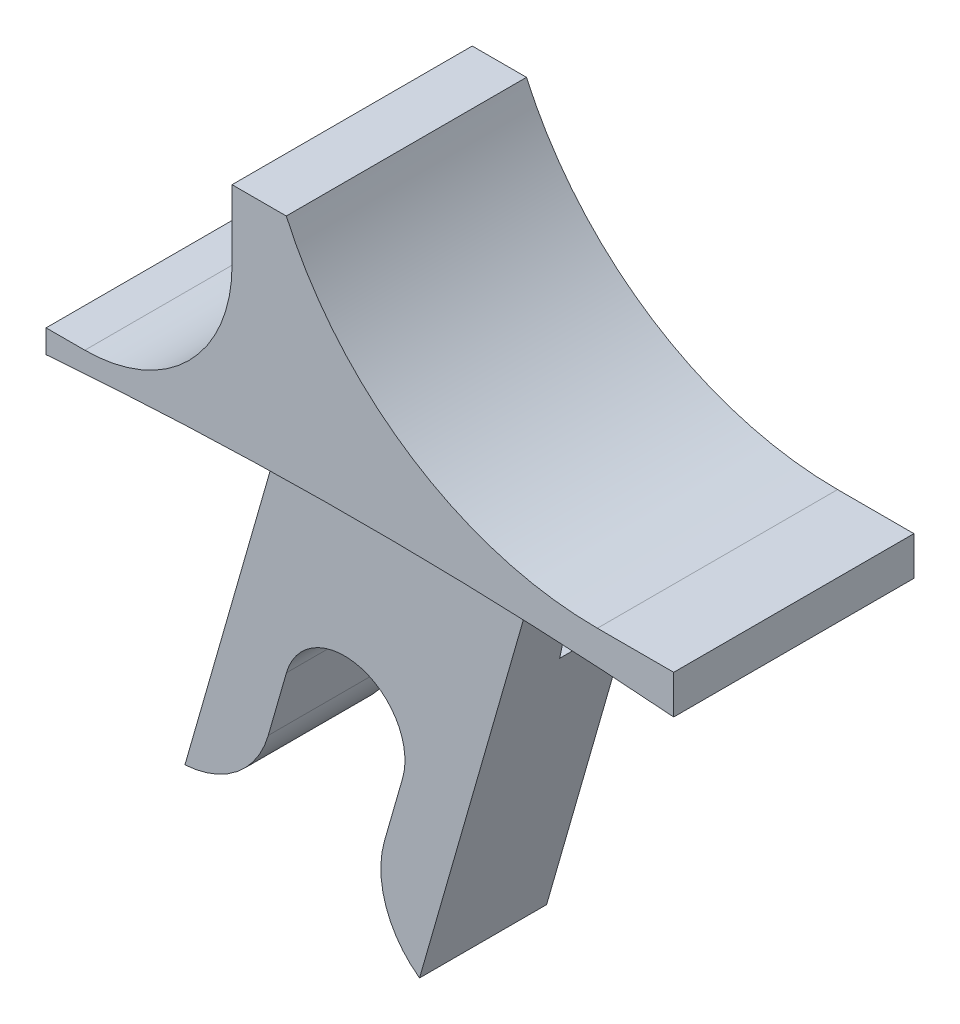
ISO-10303-21;
HEADER;
FILE_DESCRIPTION(('STEP AP214'),'2;1');
FILE_NAME('part.step','',(''),(''),'','','');
FILE_SCHEMA(('AUTOMOTIVE_DESIGN { 1 0 10303 214 1 1 1 1 }'));
ENDSEC;
DATA;
#1=APPLICATION_CONTEXT('core data for automotive mechanical design processes');
#2=APPLICATION_PROTOCOL_DEFINITION('international standard','automotive_design',2000,#1);
#3=PRODUCT_CONTEXT('',#1,'mechanical');
#4=PRODUCT('Part','Part','',(#3));
#5=PRODUCT_RELATED_PRODUCT_CATEGORY('part','',(#4));
#6=PRODUCT_DEFINITION_FORMATION('','',#4);
#7=PRODUCT_DEFINITION_CONTEXT('part definition',#1,'design');
#8=PRODUCT_DEFINITION('design','',#6,#7);
#9=PRODUCT_DEFINITION_SHAPE('','',#8);
#10=(LENGTH_UNIT() NAMED_UNIT(*) SI_UNIT(.MILLI.,.METRE.));
#11=(NAMED_UNIT(*) PLANE_ANGLE_UNIT() SI_UNIT($,.RADIAN.));
#12=(NAMED_UNIT(*) SI_UNIT($,.STERADIAN.) SOLID_ANGLE_UNIT());
#13=UNCERTAINTY_MEASURE_WITH_UNIT(LENGTH_MEASURE(1.E-05),#10,'distance_accuracy_value','');
#14=(GEOMETRIC_REPRESENTATION_CONTEXT(3) GLOBAL_UNCERTAINTY_ASSIGNED_CONTEXT((#13)) GLOBAL_UNIT_ASSIGNED_CONTEXT((#10,
#11,#12)) REPRESENTATION_CONTEXT('',''));
#15=CARTESIAN_POINT('',(0.,0.,0.));
#16=DIRECTION('',(0.,0.,1.));
#17=DIRECTION('',(1.,0.,0.));
#18=AXIS2_PLACEMENT_3D('',#15,#16,#17);
#19=CARTESIAN_POINT('',(-5.85412425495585,1.67864311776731,2.0828));
#20=DIRECTION('',(0.961261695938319,-0.275637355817,0.));
#21=DIRECTION('',(0.275637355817,0.961261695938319,0.));
#22=AXIS2_PLACEMENT_3D('',#19,#20,#21);
#23=PLANE('',#22);
#24=DIRECTION('',(-0.275637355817,-0.961261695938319,0.));
#25=VECTOR('',#24,1.);
#26=CARTESIAN_POINT('',(-5.85412425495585,1.67864311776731,-2.0828));
#27=LINE('',#26,#25);
#28=CARTESIAN_POINT('',(-7.4607423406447,-3.9243,-2.0828));
#29=VERTEX_POINT('',#28);
#30=CARTESIAN_POINT('',(-10.1861212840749,-13.4288258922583,-2.0828));
#31=VERTEX_POINT('',#30);
#32=EDGE_CURVE('E241',#29,#31,#27,.T.);
#33=ORIENTED_EDGE('',*,*,#32,.F.);
#34=DIRECTION('',(0.,0.,1.));
#35=VECTOR('',#34,1.);
#36=CARTESIAN_POINT('',(-7.4607423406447,-3.9243,2.0828));
#37=LINE('',#36,#35);
#38=CARTESIAN_POINT('',(-7.4607423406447,-3.9243,0.213824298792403));
#39=VERTEX_POINT('',#38);
#40=EDGE_CURVE('E218',#29,#39,#37,.T.);
#41=ORIENTED_EDGE('',*,*,#40,.T.);
#42=DIRECTION('',(-0.274260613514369,-0.956460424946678,-0.0998226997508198));
#43=VECTOR('',#42,1.);
#44=CARTESIAN_POINT('',(-5.81896575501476,1.80125537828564,0.811382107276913));
#45=LINE('',#44,#43);
#46=CARTESIAN_POINT('',(-6.65229240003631,-1.1049,0.508076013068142));
#47=VERTEX_POINT('',#46);
#48=EDGE_CURVE('E11',#47,#39,#45,.T.);
#49=ORIENTED_EDGE('',*,*,#48,.F.);
#50=DIRECTION('',(0.,0.,1.));
#51=VECTOR('',#50,1.);
#52=CARTESIAN_POINT('',(-6.65229240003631,-1.1049,2.0828));
#53=LINE('',#52,#51);
#54=CARTESIAN_POINT('',(-6.65229240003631,-1.1049,-2.0828));
#55=VERTEX_POINT('',#54);
#56=EDGE_CURVE('E215',#55,#47,#53,.T.);
#57=ORIENTED_EDGE('',*,*,#56,.F.);
#58=CARTESIAN_POINT('',(-6.23747108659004,0.341753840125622,-2.0828));
#59=VERTEX_POINT('',#58);
#60=EDGE_CURVE('E242',#59,#55,#27,.T.);
#61=ORIENTED_EDGE('',*,*,#60,.F.);
#62=DIRECTION('',(0.,0.,-1.));
#63=VECTOR('',#62,1.);
#64=CARTESIAN_POINT('',(-6.23747108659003,0.341753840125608,3.937));
#65=LINE('',#64,#63);
#66=CARTESIAN_POINT('',(-6.23747108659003,0.341753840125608,2.0828));
#67=VERTEX_POINT('',#66);
#68=EDGE_CURVE('E344',#67,#59,#65,.T.);
#69=ORIENTED_EDGE('',*,*,#68,.F.);
#70=DIRECTION('',(-0.275637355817,-0.961261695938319,0.));
#71=VECTOR('',#70,1.);
#72=CARTESIAN_POINT('',(-5.85412425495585,1.67864311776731,2.0828));
#73=LINE('',#72,#71);
#74=CARTESIAN_POINT('',(-10.1861212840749,-13.4288258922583,2.0828));
#75=VERTEX_POINT('',#74);
#76=EDGE_CURVE('E224',#67,#75,#73,.T.);
#77=ORIENTED_EDGE('',*,*,#76,.T.);
#78=DIRECTION('',(0.,0.,-1.));
#79=VECTOR('',#78,1.);
#80=CARTESIAN_POINT('',(-10.1861212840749,-13.4288258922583,2.0828));
#81=LINE('',#80,#79);
#82=EDGE_CURVE('E270',#75,#31,#81,.T.);
#83=ORIENTED_EDGE('',*,*,#82,.T.);
#84=EDGE_LOOP('',(#33,#41,#49,#57,#61,#69,#77,#83));
#85=FACE_BOUND('',#84,.T.);
#86=ADVANCED_FACE('F39',(#85),#23,.T.);
#87=CARTESIAN_POINT('',(-13.5451790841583,3.88401760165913,2.0828));
#88=DIRECTION('',(0.961261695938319,-0.275637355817,0.));
#89=DIRECTION('',(0.275637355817,0.961261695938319,0.));
#90=AXIS2_PLACEMENT_3D('',#87,#88,#89);
#91=PLANE('',#90);
#92=DIRECTION('',(0.,0.,1.));
#93=VECTOR('',#92,1.);
#94=CARTESIAN_POINT('',(-15.7841781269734,-3.9243,2.0828));
#95=LINE('',#94,#93);
#96=CARTESIAN_POINT('',(-15.7841781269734,-3.9243,-2.0828));
#97=VERTEX_POINT('',#96);
#98=CARTESIAN_POINT('',(-15.7841781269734,-3.9243,0.22485857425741));
#99=VERTEX_POINT('',#98);
#100=EDGE_CURVE('E195',#97,#99,#95,.T.);
#101=ORIENTED_EDGE('',*,*,#100,.F.);
#102=DIRECTION('',(-0.275637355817,-0.961261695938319,0.));
#103=VECTOR('',#102,1.);
#104=CARTESIAN_POINT('',(-13.5451790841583,3.88401760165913,-2.0828));
#105=LINE('',#104,#103);
#106=CARTESIAN_POINT('',(-17.8771761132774,-11.2234514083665,-2.0828));
#107=VERTEX_POINT('',#106);
#108=EDGE_CURVE('E245',#97,#107,#105,.T.);
#109=ORIENTED_EDGE('',*,*,#108,.T.);
#110=DIRECTION('',(0.,0.,-1.));
#111=VECTOR('',#110,1.);
#112=CARTESIAN_POINT('',(-17.8771761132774,-11.2234514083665,2.0828));
#113=LINE('',#112,#111);
#114=CARTESIAN_POINT('',(-17.8771761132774,-11.2234514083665,2.0828));
#115=VERTEX_POINT('',#114);
#116=EDGE_CURVE('E267',#115,#107,#113,.T.);
#117=ORIENTED_EDGE('',*,*,#116,.F.);
#118=DIRECTION('',(-0.275637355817,-0.961261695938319,0.));
#119=VECTOR('',#118,1.);
#120=CARTESIAN_POINT('',(-13.5451790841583,3.88401760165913,2.0828));
#121=LINE('',#120,#119);
#122=CARTESIAN_POINT('',(-14.5629702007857,0.334558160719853,2.0828));
#123=VERTEX_POINT('',#122);
#124=EDGE_CURVE('E227',#123,#115,#121,.T.);
#125=ORIENTED_EDGE('',*,*,#124,.F.);
#126=DIRECTION('',(0.,0.,-1.));
#127=VECTOR('',#126,1.);
#128=CARTESIAN_POINT('',(-14.5629702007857,0.334558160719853,3.937));
#129=LINE('',#128,#127);
#130=CARTESIAN_POINT('',(-14.5629702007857,0.334558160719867,-2.0828));
#131=VERTEX_POINT('',#130);
#132=EDGE_CURVE('E341',#123,#131,#129,.T.);
#133=ORIENTED_EDGE('',*,*,#132,.T.);
#134=CARTESIAN_POINT('',(-14.975728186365,-1.1049,-2.0828));
#135=VERTEX_POINT('',#134);
#136=EDGE_CURVE('E246',#131,#135,#105,.T.);
#137=ORIENTED_EDGE('',*,*,#136,.T.);
#138=DIRECTION('',(0.,0.,1.));
#139=VECTOR('',#138,1.);
#140=CARTESIAN_POINT('',(-14.975728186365,-1.1049,2.0828));
#141=LINE('',#140,#139);
#142=CARTESIAN_POINT('',(-14.975728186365,-1.1049,-0.0693931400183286));
#143=VERTEX_POINT('',#142);
#144=EDGE_CURVE('E54',#135,#143,#141,.T.);
#145=ORIENTED_EDGE('',*,*,#144,.T.);
#146=DIRECTION('',(-0.274260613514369,-0.956460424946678,0.0998226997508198));
#147=VECTOR('',#146,1.);
#148=CARTESIAN_POINT('',(-13.6183554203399,3.62882138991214,-0.563436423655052));
#149=LINE('',#148,#147);
#150=EDGE_CURVE('E47',#143,#99,#149,.T.);
#151=ORIENTED_EDGE('',*,*,#150,.T.);
#152=EDGE_LOOP('',(#101,#109,#117,#125,#133,#137,#145,#151));
#153=FACE_BOUND('',#152,.T.);
#154=ADVANCED_FACE('F351',(#153),#91,.F.);
#155=CARTESIAN_POINT('',(0.,0.,-2.0828));
#156=DIRECTION('',(0.,0.,1.));
#157=DIRECTION('',(1.,0.,0.));
#158=AXIS2_PLACEMENT_3D('',#155,#156,#157);
#159=PLANE('',#158);
#160=DIRECTION('',(-1.,0.,0.));
#161=VECTOR('',#160,1.);
#162=CARTESIAN_POINT('',(0.,-3.9243,-2.0828));
#163=LINE('',#162,#161);
#164=EDGE_CURVE('E349',#29,#97,#163,.T.);
#165=ORIENTED_EDGE('',*,*,#164,.F.);
#166=ORIENTED_EDGE('',*,*,#32,.T.);
#167=CARTESIAN_POINT('',(-8.40642364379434,-10.9543602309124,-2.0828));
#168=DIRECTION('',(0.,0.,1.));
#169=DIRECTION('',(1.,0.,0.));
#170=AXIS2_PLACEMENT_3D('',#167,#168,#169);
#171=CIRCLE('',#170,3.04800000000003);
#172=CARTESIAN_POINT('',(-11.3363492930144,-10.1142175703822,-2.0828));
#173=VERTEX_POINT('',#172);
#174=EDGE_CURVE('E220',#31,#173,#171,.F.);
#175=ORIENTED_EDGE('',*,*,#174,.T.);
#176=DIRECTION('',(-0.275637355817,-0.961261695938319,0.));
#177=VECTOR('',#176,1.);
#178=CARTESIAN_POINT('',(-7.79519999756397,2.23523763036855,-2.0828));
#179=LINE('',#178,#177);
#180=CARTESIAN_POINT('',(-10.7413168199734,-8.03909272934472,-2.0828));
#181=VERTEX_POINT('',#180);
#182=EDGE_CURVE('E225',#181,#173,#179,.T.);
#183=ORIENTED_EDGE('',*,*,#182,.F.);
#184=CARTESIAN_POINT('',(-12.6457684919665,-7.49300000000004,-2.0828));
#185=DIRECTION('',(0.,0.,1.));
#186=DIRECTION('',(1.,0.,0.));
#187=AXIS2_PLACEMENT_3D('',#184,#185,#186);
#188=CIRCLE('',#187,1.98120000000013);
#189=CARTESIAN_POINT('',(-14.5502201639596,-6.94690727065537,-2.0828));
#190=VERTEX_POINT('',#189);
#191=EDGE_CURVE('E255',#190,#181,#188,.F.);
#192=ORIENTED_EDGE('',*,*,#191,.F.);
#193=DIRECTION('',(-0.275637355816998,-0.961261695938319,0.));
#194=VECTOR('',#193,1.);
#195=CARTESIAN_POINT('',(-11.6041033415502,3.32742308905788,-2.0828));
#196=LINE('',#195,#194);
#197=CARTESIAN_POINT('',(-15.1452526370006,-9.02203211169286,-2.0828));
#198=VERTEX_POINT('',#197);
#199=EDGE_CURVE('E252',#190,#198,#196,.T.);
#200=ORIENTED_EDGE('',*,*,#199,.T.);
#201=CARTESIAN_POINT('',(-18.0751782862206,-8.18188945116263,-2.0828));
#202=DIRECTION('',(0.,0.,1.));
#203=DIRECTION('',(1.,0.,0.));
#204=AXIS2_PLACEMENT_3D('',#201,#202,#203);
#205=CIRCLE('',#204,3.04800000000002);
#206=EDGE_CURVE('E249',#107,#198,#205,.T.);
#207=ORIENTED_EDGE('',*,*,#206,.F.);
#208=ORIENTED_EDGE('',*,*,#108,.F.);
#209=EDGE_LOOP('',(#165,#166,#175,#183,#192,#200,#207,#208));
#210=FACE_BOUND('',#209,.T.);
#211=ADVANCED_FACE('F360',(#210),#159,.F.);
#212=CARTESIAN_POINT('',(-10.287,-130.659671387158,3.937));
#213=DIRECTION('',(0.,0.,-1.));
#214=DIRECTION('',(-1.,0.,0.));
#215=AXIS2_PLACEMENT_3D('',#212,#213,#214);
#216=CYLINDRICAL_SURFACE('',#215,131.064);
#217=ORIENTED_EDGE('',*,*,#132,.F.);
#218=CARTESIAN_POINT('',(-10.287,-130.659671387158,2.0828));
#219=DIRECTION('',(0.,0.,1.));
#220=DIRECTION('',(1.,0.,0.));
#221=AXIS2_PLACEMENT_3D('',#218,#219,#220);
#222=CIRCLE('',#221,131.064);
#223=EDGE_CURVE('E62',#123,#67,#222,.F.);
#224=ORIENTED_EDGE('',*,*,#223,.T.);
#225=ORIENTED_EDGE('',*,*,#68,.T.);
#226=CARTESIAN_POINT('',(-10.287,-130.659671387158,-2.0828));
#227=DIRECTION('',(0.,0.,1.));
#228=DIRECTION('',(1.,0.,0.));
#229=AXIS2_PLACEMENT_3D('',#226,#227,#228);
#230=CIRCLE('',#229,131.064);
#231=EDGE_CURVE('E338',#131,#59,#230,.F.);
#232=ORIENTED_EDGE('',*,*,#231,.F.);
#233=EDGE_LOOP('',(#217,#224,#225,#232));
#234=FACE_BOUND('',#233,.T.);
#235=CARTESIAN_POINT('',(-10.287,-130.659671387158,-3.937));
#236=DIRECTION('',(0.,0.,-1.));
#237=DIRECTION('',(-1.,0.,0.));
#238=AXIS2_PLACEMENT_3D('',#235,#236,#237);
#239=CIRCLE('',#238,131.064);
#240=CARTESIAN_POINT('',(-20.574,0.,-3.937));
#241=VERTEX_POINT('',#240);
#242=CARTESIAN_POINT('',(0.,0.,-3.937));
#243=VERTEX_POINT('',#242);
#244=EDGE_CURVE('E273',#241,#243,#239,.T.);
#245=ORIENTED_EDGE('',*,*,#244,.T.);
#246=DIRECTION('',(0.,0.,-1.));
#247=VECTOR('',#246,1.);
#248=CARTESIAN_POINT('',(0.,0.,3.937));
#249=LINE('',#248,#247);
#250=CARTESIAN_POINT('',(0.,0.,3.937));
#251=VERTEX_POINT('',#250);
#252=EDGE_CURVE('E335',#251,#243,#249,.T.);
#253=ORIENTED_EDGE('',*,*,#252,.F.);
#254=CARTESIAN_POINT('',(-10.287,-130.659671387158,3.937));
#255=DIRECTION('',(0.,0.,-1.));
#256=DIRECTION('',(-1.,0.,0.));
#257=AXIS2_PLACEMENT_3D('',#254,#255,#256);
#258=CIRCLE('',#257,131.064);
#259=CARTESIAN_POINT('',(-20.574,0.,3.937));
#260=VERTEX_POINT('',#259);
#261=EDGE_CURVE('E274',#260,#251,#258,.T.);
#262=ORIENTED_EDGE('',*,*,#261,.F.);
#263=DIRECTION('',(0.,0.,-1.));
#264=VECTOR('',#263,1.);
#265=CARTESIAN_POINT('',(-20.574,0.,3.937));
#266=LINE('',#265,#264);
#267=EDGE_CURVE('E294',#260,#241,#266,.T.);
#268=ORIENTED_EDGE('',*,*,#267,.T.);
#269=EDGE_LOOP('',(#245,#253,#262,#268));
#270=FACE_BOUND('',#269,.T.);
#271=ADVANCED_FACE('F41',(#234,#270),#216,.F.);
#272=CARTESIAN_POINT('',(0.,0.,3.937));
#273=DIRECTION('',(-1.,0.,0.));
#274=DIRECTION('',(0.,-1.,0.));
#275=AXIS2_PLACEMENT_3D('',#272,#273,#274);
#276=PLANE('',#275);
#277=DIRECTION('',(0.,1.,0.));
#278=VECTOR('',#277,1.);
#279=CARTESIAN_POINT('',(0.,0.,-3.937));
#280=LINE('',#279,#278);
#281=CARTESIAN_POINT('',(0.,1.27,-3.937));
#282=VERTEX_POINT('',#281);
#283=EDGE_CURVE('E297',#243,#282,#280,.T.);
#284=ORIENTED_EDGE('',*,*,#283,.T.);
#285=DIRECTION('',(0.,0.,-1.));
#286=VECTOR('',#285,1.);
#287=CARTESIAN_POINT('',(0.,1.27,3.937));
#288=LINE('',#287,#286);
#289=CARTESIAN_POINT('',(0.,1.27,3.937));
#290=VERTEX_POINT('',#289);
#291=EDGE_CURVE('E332',#290,#282,#288,.T.);
#292=ORIENTED_EDGE('',*,*,#291,.F.);
#293=DIRECTION('',(0.,1.,0.));
#294=VECTOR('',#293,1.);
#295=CARTESIAN_POINT('',(0.,0.,3.937));
#296=LINE('',#295,#294);
#297=EDGE_CURVE('E277',#251,#290,#296,.T.);
#298=ORIENTED_EDGE('',*,*,#297,.F.);
#299=ORIENTED_EDGE('',*,*,#252,.T.);
#300=EDGE_LOOP('',(#284,#292,#298,#299));
#301=FACE_BOUND('',#300,.T.);
#302=ADVANCED_FACE('F444',(#301),#276,.F.);
#303=CARTESIAN_POINT('',(0.,1.27,3.937));
#304=DIRECTION('',(0.,-1.,0.));
#305=DIRECTION('',(1.,0.,0.));
#306=AXIS2_PLACEMENT_3D('',#303,#304,#305);
#307=PLANE('',#306);
#308=DIRECTION('',(-1.,0.,0.));
#309=VECTOR('',#308,1.);
#310=CARTESIAN_POINT('',(0.,1.27,-3.937));
#311=LINE('',#310,#309);
#312=CARTESIAN_POINT('',(-2.50197117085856,1.27,-3.937));
#313=VERTEX_POINT('',#312);
#314=EDGE_CURVE('E299',#282,#313,#311,.T.);
#315=ORIENTED_EDGE('',*,*,#314,.T.);
#316=DIRECTION('',(0.,0.,-1.));
#317=VECTOR('',#316,1.);
#318=CARTESIAN_POINT('',(-2.50197117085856,1.27,3.937));
#319=LINE('',#318,#317);
#320=CARTESIAN_POINT('',(-2.50197117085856,1.27,3.937));
#321=VERTEX_POINT('',#320);
#322=EDGE_CURVE('E329',#321,#313,#319,.T.);
#323=ORIENTED_EDGE('',*,*,#322,.F.);
#324=DIRECTION('',(-1.,0.,0.));
#325=VECTOR('',#324,1.);
#326=CARTESIAN_POINT('',(0.,1.27,3.937));
#327=LINE('',#326,#325);
#328=EDGE_CURVE('E280',#290,#321,#327,.T.);
#329=ORIENTED_EDGE('',*,*,#328,.F.);
#330=ORIENTED_EDGE('',*,*,#291,.T.);
#331=EDGE_LOOP('',(#315,#323,#329,#330));
#332=FACE_BOUND('',#331,.T.);
#333=ADVANCED_FACE('F441',(#332),#307,.F.);
#334=CARTESIAN_POINT('',(-2.50197117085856,12.446,3.937));
#335=DIRECTION('',(0.,0.,-1.));
#336=DIRECTION('',(-1.,0.,0.));
#337=AXIS2_PLACEMENT_3D('',#334,#335,#336);
#338=CYLINDRICAL_SURFACE('',#337,11.176);
#339=CARTESIAN_POINT('',(-2.50197117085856,12.446,-3.937));
#340=DIRECTION('',(0.,0.,-1.));
#341=DIRECTION('',(1.,0.,0.));
#342=AXIS2_PLACEMENT_3D('',#339,#340,#341);
#343=CIRCLE('',#342,11.176);
#344=CARTESIAN_POINT('',(-12.7,7.874,-3.937));
#345=VERTEX_POINT('',#344);
#346=EDGE_CURVE('E301',#313,#345,#343,.T.);
#347=ORIENTED_EDGE('',*,*,#346,.T.);
#348=DIRECTION('',(0.,0.,-1.));
#349=VECTOR('',#348,1.);
#350=CARTESIAN_POINT('',(-12.7,7.874,3.937));
#351=LINE('',#350,#349);
#352=CARTESIAN_POINT('',(-12.7,7.874,3.937));
#353=VERTEX_POINT('',#352);
#354=EDGE_CURVE('E326',#353,#345,#351,.T.);
#355=ORIENTED_EDGE('',*,*,#354,.F.);
#356=CARTESIAN_POINT('',(-2.50197117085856,12.446,3.937));
#357=DIRECTION('',(0.,0.,-1.));
#358=DIRECTION('',(1.,0.,0.));
#359=AXIS2_PLACEMENT_3D('',#356,#357,#358);
#360=CIRCLE('',#359,11.176);
#361=EDGE_CURVE('E282',#321,#353,#360,.T.);
#362=ORIENTED_EDGE('',*,*,#361,.F.);
#363=ORIENTED_EDGE('',*,*,#322,.T.);
#364=EDGE_LOOP('',(#347,#355,#362,#363));
#365=FACE_BOUND('',#364,.T.);
#366=ADVANCED_FACE('F437',(#365),#338,.F.);
#367=CARTESIAN_POINT('',(-12.7,7.874,3.937));
#368=DIRECTION('',(0.,-1.,0.));
#369=DIRECTION('',(0.,0.,-1.));
#370=AXIS2_PLACEMENT_3D('',#367,#368,#369);
#371=PLANE('',#370);
#372=DIRECTION('',(-1.,0.,0.));
#373=VECTOR('',#372,1.);
#374=CARTESIAN_POINT('',(-12.7,7.874,-3.937));
#375=LINE('',#374,#373);
#376=CARTESIAN_POINT('',(-14.478,7.874,-3.937));
#377=VERTEX_POINT('',#376);
#378=EDGE_CURVE('E303',#345,#377,#375,.T.);
#379=ORIENTED_EDGE('',*,*,#378,.T.);
#380=DIRECTION('',(0.,0.,-1.));
#381=VECTOR('',#380,1.);
#382=CARTESIAN_POINT('',(-14.478,7.874,3.937));
#383=LINE('',#382,#381);
#384=CARTESIAN_POINT('',(-14.478,7.874,3.937));
#385=VERTEX_POINT('',#384);
#386=EDGE_CURVE('E323',#385,#377,#383,.T.);
#387=ORIENTED_EDGE('',*,*,#386,.F.);
#388=DIRECTION('',(-1.,0.,0.));
#389=VECTOR('',#388,1.);
#390=CARTESIAN_POINT('',(-12.7,7.874,3.937));
#391=LINE('',#390,#389);
#392=EDGE_CURVE('E284',#353,#385,#391,.T.);
#393=ORIENTED_EDGE('',*,*,#392,.F.);
#394=ORIENTED_EDGE('',*,*,#354,.T.);
#395=EDGE_LOOP('',(#379,#387,#393,#394));
#396=FACE_BOUND('',#395,.T.);
#397=ADVANCED_FACE('F433',(#396),#371,.F.);
#398=CARTESIAN_POINT('',(-14.478,7.874,3.937));
#399=DIRECTION('',(1.,0.,0.));
#400=DIRECTION('',(0.,0.,-1.));
#401=AXIS2_PLACEMENT_3D('',#398,#399,#400);
#402=PLANE('',#401);
#403=DIRECTION('',(0.,-1.,0.));
#404=VECTOR('',#403,1.);
#405=CARTESIAN_POINT('',(-14.478,7.874,-3.937));
#406=LINE('',#405,#404);
#407=CARTESIAN_POINT('',(-14.478,5.58800000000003,-3.937));
#408=VERTEX_POINT('',#407);
#409=EDGE_CURVE('E305',#377,#408,#406,.T.);
#410=ORIENTED_EDGE('',*,*,#409,.T.);
#411=DIRECTION('',(0.,0.,-1.));
#412=VECTOR('',#411,1.);
#413=CARTESIAN_POINT('',(-14.478,5.58800000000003,3.937));
#414=LINE('',#413,#412);
#415=CARTESIAN_POINT('',(-14.478,5.58800000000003,3.937));
#416=VERTEX_POINT('',#415);
#417=EDGE_CURVE('E320',#416,#408,#414,.T.);
#418=ORIENTED_EDGE('',*,*,#417,.F.);
#419=DIRECTION('',(0.,-1.,0.));
#420=VECTOR('',#419,1.);
#421=CARTESIAN_POINT('',(-14.478,7.874,3.937));
#422=LINE('',#421,#420);
#423=EDGE_CURVE('E286',#385,#416,#422,.T.);
#424=ORIENTED_EDGE('',*,*,#423,.F.);
#425=ORIENTED_EDGE('',*,*,#386,.T.);
#426=EDGE_LOOP('',(#410,#418,#424,#425));
#427=FACE_BOUND('',#426,.T.);
#428=ADVANCED_FACE('F429',(#427),#402,.F.);
#429=CARTESIAN_POINT('',(-19.304,5.588,3.937));
#430=DIRECTION('',(0.,0.,-1.));
#431=DIRECTION('',(-1.,0.,0.));
#432=AXIS2_PLACEMENT_3D('',#429,#430,#431);
#433=CYLINDRICAL_SURFACE('',#432,4.826);
#434=CARTESIAN_POINT('',(-19.304,5.588,-3.937));
#435=DIRECTION('',(0.,0.,-1.));
#436=DIRECTION('',(-1.,0.,0.));
#437=AXIS2_PLACEMENT_3D('',#434,#435,#436);
#438=CIRCLE('',#437,4.826);
#439=CARTESIAN_POINT('',(-19.304,0.761999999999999,-3.937));
#440=VERTEX_POINT('',#439);
#441=EDGE_CURVE('E307',#408,#440,#438,.T.);
#442=ORIENTED_EDGE('',*,*,#441,.T.);
#443=DIRECTION('',(0.,0.,-1.));
#444=VECTOR('',#443,1.);
#445=CARTESIAN_POINT('',(-19.304,0.761999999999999,3.937));
#446=LINE('',#445,#444);
#447=CARTESIAN_POINT('',(-19.304,0.761999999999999,3.937));
#448=VERTEX_POINT('',#447);
#449=EDGE_CURVE('E317',#448,#440,#446,.T.);
#450=ORIENTED_EDGE('',*,*,#449,.F.);
#451=CARTESIAN_POINT('',(-19.304,5.588,3.937));
#452=DIRECTION('',(0.,0.,-1.));
#453=DIRECTION('',(-1.,0.,0.));
#454=AXIS2_PLACEMENT_3D('',#451,#452,#453);
#455=CIRCLE('',#454,4.826);
#456=EDGE_CURVE('E288',#416,#448,#455,.T.);
#457=ORIENTED_EDGE('',*,*,#456,.F.);
#458=ORIENTED_EDGE('',*,*,#417,.T.);
#459=EDGE_LOOP('',(#442,#450,#457,#458));
#460=FACE_BOUND('',#459,.T.);
#461=ADVANCED_FACE('F425',(#460),#433,.F.);
#462=CARTESIAN_POINT('',(-19.304,0.761999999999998,3.937));
#463=DIRECTION('',(0.,-1.,0.));
#464=DIRECTION('',(1.,0.,0.));
#465=AXIS2_PLACEMENT_3D('',#462,#463,#464);
#466=PLANE('',#465);
#467=DIRECTION('',(-1.,0.,0.));
#468=VECTOR('',#467,1.);
#469=CARTESIAN_POINT('',(-19.304,0.761999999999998,-3.937));
#470=LINE('',#469,#468);
#471=CARTESIAN_POINT('',(-20.574,0.761999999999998,-3.937));
#472=VERTEX_POINT('',#471);
#473=EDGE_CURVE('E309',#440,#472,#470,.T.);
#474=ORIENTED_EDGE('',*,*,#473,.T.);
#475=DIRECTION('',(0.,0.,-1.));
#476=VECTOR('',#475,1.);
#477=CARTESIAN_POINT('',(-20.574,0.761999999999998,3.937));
#478=LINE('',#477,#476);
#479=CARTESIAN_POINT('',(-20.574,0.761999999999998,3.937));
#480=VERTEX_POINT('',#479);
#481=EDGE_CURVE('E314',#480,#472,#478,.T.);
#482=ORIENTED_EDGE('',*,*,#481,.F.);
#483=DIRECTION('',(-1.,0.,0.));
#484=VECTOR('',#483,1.);
#485=CARTESIAN_POINT('',(-19.304,0.761999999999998,3.937));
#486=LINE('',#485,#484);
#487=EDGE_CURVE('E290',#448,#480,#486,.T.);
#488=ORIENTED_EDGE('',*,*,#487,.F.);
#489=ORIENTED_EDGE('',*,*,#449,.T.);
#490=EDGE_LOOP('',(#474,#482,#488,#489));
#491=FACE_BOUND('',#490,.T.);
#492=ADVANCED_FACE('F421',(#491),#466,.F.);
#493=CARTESIAN_POINT('',(-20.574,0.761999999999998,3.937));
#494=DIRECTION('',(1.,0.,0.));
#495=DIRECTION('',(0.,0.,-1.));
#496=AXIS2_PLACEMENT_3D('',#493,#494,#495);
#497=PLANE('',#496);
#498=DIRECTION('',(0.,-1.,0.));
#499=VECTOR('',#498,1.);
#500=CARTESIAN_POINT('',(-20.574,0.761999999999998,-3.937));
#501=LINE('',#500,#499);
#502=EDGE_CURVE('E278',#472,#241,#501,.T.);
#503=ORIENTED_EDGE('',*,*,#502,.T.);
#504=ORIENTED_EDGE('',*,*,#267,.F.);
#505=DIRECTION('',(0.,-1.,0.));
#506=VECTOR('',#505,1.);
#507=CARTESIAN_POINT('',(-20.574,0.761999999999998,3.937));
#508=LINE('',#507,#506);
#509=EDGE_CURVE('E292',#480,#260,#508,.T.);
#510=ORIENTED_EDGE('',*,*,#509,.F.);
#511=ORIENTED_EDGE('',*,*,#481,.T.);
#512=EDGE_LOOP('',(#503,#504,#510,#511));
#513=FACE_BOUND('',#512,.T.);
#514=ADVANCED_FACE('F414',(#513),#497,.F.);
#515=CARTESIAN_POINT('',(-10.287,-130.659671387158,3.937));
#516=DIRECTION('',(0.,0.,-1.));
#517=DIRECTION('',(-1.,0.,0.));
#518=AXIS2_PLACEMENT_3D('',#515,#516,#517);
#519=PLANE('',#518);
#520=ORIENTED_EDGE('',*,*,#261,.T.);
#521=ORIENTED_EDGE('',*,*,#297,.T.);
#522=ORIENTED_EDGE('',*,*,#328,.T.);
#523=ORIENTED_EDGE('',*,*,#361,.T.);
#524=ORIENTED_EDGE('',*,*,#392,.T.);
#525=ORIENTED_EDGE('',*,*,#423,.T.);
#526=ORIENTED_EDGE('',*,*,#456,.T.);
#527=ORIENTED_EDGE('',*,*,#487,.T.);
#528=ORIENTED_EDGE('',*,*,#509,.T.);
#529=EDGE_LOOP('',(#520,#521,#522,#523,#524,#525,#526,#527,#528));
#530=FACE_BOUND('',#529,.T.);
#531=ADVANCED_FACE('F410',(#530),#519,.F.);
#532=CARTESIAN_POINT('',(-10.287,-130.659671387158,-3.937));
#533=DIRECTION('',(0.,0.,-1.));
#534=DIRECTION('',(-1.,0.,0.));
#535=AXIS2_PLACEMENT_3D('',#532,#533,#534);
#536=PLANE('',#535);
#537=ORIENTED_EDGE('',*,*,#244,.F.);
#538=ORIENTED_EDGE('',*,*,#502,.F.);
#539=ORIENTED_EDGE('',*,*,#473,.F.);
#540=ORIENTED_EDGE('',*,*,#441,.F.);
#541=ORIENTED_EDGE('',*,*,#409,.F.);
#542=ORIENTED_EDGE('',*,*,#378,.F.);
#543=ORIENTED_EDGE('',*,*,#346,.F.);
#544=ORIENTED_EDGE('',*,*,#314,.F.);
#545=ORIENTED_EDGE('',*,*,#283,.F.);
#546=EDGE_LOOP('',(#537,#538,#539,#540,#541,#542,#543,#544,#545));
#547=FACE_BOUND('',#546,.T.);
#548=ADVANCED_FACE('F413',(#547),#536,.T.);
#549=CARTESIAN_POINT('',(0.,0.,2.0828));
#550=DIRECTION('',(0.,0.,1.));
#551=DIRECTION('',(1.,0.,0.));
#552=AXIS2_PLACEMENT_3D('',#549,#550,#551);
#553=PLANE('',#552);
#554=ORIENTED_EDGE('',*,*,#223,.F.);
#555=ORIENTED_EDGE('',*,*,#124,.T.);
#556=CARTESIAN_POINT('',(-18.0751782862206,-8.18188945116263,2.0828));
#557=DIRECTION('',(0.,0.,1.));
#558=DIRECTION('',(1.,0.,0.));
#559=AXIS2_PLACEMENT_3D('',#556,#557,#558);
#560=CIRCLE('',#559,3.04800000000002);
#561=CARTESIAN_POINT('',(-15.1452526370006,-9.02203211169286,2.0828));
#562=VERTEX_POINT('',#561);
#563=EDGE_CURVE('E229',#115,#562,#560,.T.);
#564=ORIENTED_EDGE('',*,*,#563,.T.);
#565=DIRECTION('',(-0.275637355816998,-0.961261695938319,0.));
#566=VECTOR('',#565,1.);
#567=CARTESIAN_POINT('',(-11.6041033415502,3.32742308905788,2.0828));
#568=LINE('',#567,#566);
#569=CARTESIAN_POINT('',(-14.5502201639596,-6.94690727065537,2.0828));
#570=VERTEX_POINT('',#569);
#571=EDGE_CURVE('E231',#570,#562,#568,.T.);
#572=ORIENTED_EDGE('',*,*,#571,.F.);
#573=CARTESIAN_POINT('',(-12.6457684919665,-7.49300000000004,2.0828));
#574=DIRECTION('',(0.,0.,1.));
#575=DIRECTION('',(1.,0.,0.));
#576=AXIS2_PLACEMENT_3D('',#573,#574,#575);
#577=CIRCLE('',#576,1.98120000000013);
#578=CARTESIAN_POINT('',(-10.7413168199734,-8.03909272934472,2.0828));
#579=VERTEX_POINT('',#578);
#580=EDGE_CURVE('E234',#570,#579,#577,.F.);
#581=ORIENTED_EDGE('',*,*,#580,.T.);
#582=DIRECTION('',(-0.275637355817,-0.961261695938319,0.));
#583=VECTOR('',#582,1.);
#584=CARTESIAN_POINT('',(-7.79519999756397,2.23523763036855,2.0828));
#585=LINE('',#584,#583);
#586=CARTESIAN_POINT('',(-11.3363492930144,-10.1142175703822,2.0828));
#587=VERTEX_POINT('',#586);
#588=EDGE_CURVE('E236',#579,#587,#585,.T.);
#589=ORIENTED_EDGE('',*,*,#588,.T.);
#590=CARTESIAN_POINT('',(-8.40642364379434,-10.9543602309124,2.0828));
#591=DIRECTION('',(0.,0.,1.));
#592=DIRECTION('',(1.,0.,0.));
#593=AXIS2_PLACEMENT_3D('',#590,#591,#592);
#594=CIRCLE('',#593,3.04800000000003);
#595=EDGE_CURVE('E221',#75,#587,#594,.F.);
#596=ORIENTED_EDGE('',*,*,#595,.F.);
#597=ORIENTED_EDGE('',*,*,#76,.F.);
#598=EDGE_LOOP('',(#554,#555,#564,#572,#581,#589,#596,#597));
#599=FACE_BOUND('',#598,.T.);
#600=ADVANCED_FACE('F370',(#599),#553,.T.);
#601=ORIENTED_EDGE('',*,*,#60,.T.);
#602=DIRECTION('',(-1.,0.,0.));
#603=VECTOR('',#602,1.);
#604=CARTESIAN_POINT('',(0.,-1.1049,-2.0828));
#605=LINE('',#604,#603);
#606=EDGE_CURVE('E347',#55,#135,#605,.T.);
#607=ORIENTED_EDGE('',*,*,#606,.T.);
#608=ORIENTED_EDGE('',*,*,#136,.F.);
#609=ORIENTED_EDGE('',*,*,#231,.T.);
#610=EDGE_LOOP('',(#601,#607,#608,#609));
#611=FACE_BOUND('',#610,.T.);
#612=ADVANCED_FACE('F374',(#611),#159,.F.);
#613=CARTESIAN_POINT('',(-8.40642364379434,-10.9543602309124,2.0828));
#614=DIRECTION('',(0.,0.,-1.));
#615=DIRECTION('',(-1.,0.,0.));
#616=AXIS2_PLACEMENT_3D('',#613,#614,#615);
#617=CYLINDRICAL_SURFACE('',#616,3.04800000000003);
#618=ORIENTED_EDGE('',*,*,#174,.F.);
#619=ORIENTED_EDGE('',*,*,#82,.F.);
#620=ORIENTED_EDGE('',*,*,#595,.T.);
#621=DIRECTION('',(0.,0.,-1.));
#622=VECTOR('',#621,1.);
#623=CARTESIAN_POINT('',(-11.3363492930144,-10.1142175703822,2.0828));
#624=LINE('',#623,#622);
#625=EDGE_CURVE('E238',#587,#173,#624,.T.);
#626=ORIENTED_EDGE('',*,*,#625,.T.);
#627=EDGE_LOOP('',(#618,#619,#620,#626));
#628=FACE_BOUND('',#627,.T.);
#629=ADVANCED_FACE('F381',(#628),#617,.T.);
#630=CARTESIAN_POINT('',(-18.0751782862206,-8.18188945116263,2.0828));
#631=DIRECTION('',(0.,0.,-1.));
#632=DIRECTION('',(-1.,0.,0.));
#633=AXIS2_PLACEMENT_3D('',#630,#631,#632);
#634=CYLINDRICAL_SURFACE('',#633,3.04800000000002);
#635=ORIENTED_EDGE('',*,*,#206,.T.);
#636=DIRECTION('',(0.,0.,-1.));
#637=VECTOR('',#636,1.);
#638=CARTESIAN_POINT('',(-15.1452526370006,-9.02203211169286,2.0828));
#639=LINE('',#638,#637);
#640=EDGE_CURVE('E265',#562,#198,#639,.T.);
#641=ORIENTED_EDGE('',*,*,#640,.F.);
#642=ORIENTED_EDGE('',*,*,#563,.F.);
#643=ORIENTED_EDGE('',*,*,#116,.T.);
#644=EDGE_LOOP('',(#635,#641,#642,#643));
#645=FACE_BOUND('',#644,.T.);
#646=ADVANCED_FACE('F366',(#645),#634,.T.);
#647=CARTESIAN_POINT('',(-11.6041033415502,3.32742308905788,2.0828));
#648=DIRECTION('',(0.961261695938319,-0.275637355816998,0.));
#649=DIRECTION('',(0.275637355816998,0.961261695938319,0.));
#650=AXIS2_PLACEMENT_3D('',#647,#648,#649);
#651=PLANE('',#650);
#652=ORIENTED_EDGE('',*,*,#199,.F.);
#653=DIRECTION('',(0.,0.,-1.));
#654=VECTOR('',#653,1.);
#655=CARTESIAN_POINT('',(-14.5502201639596,-6.94690727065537,2.0828));
#656=LINE('',#655,#654);
#657=EDGE_CURVE('E263',#570,#190,#656,.T.);
#658=ORIENTED_EDGE('',*,*,#657,.F.);
#659=ORIENTED_EDGE('',*,*,#571,.T.);
#660=ORIENTED_EDGE('',*,*,#640,.T.);
#661=EDGE_LOOP('',(#652,#658,#659,#660));
#662=FACE_BOUND('',#661,.T.);
#663=ADVANCED_FACE('F392',(#662),#651,.T.);
#664=CARTESIAN_POINT('',(-12.6457684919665,-7.49300000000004,2.0828));
#665=DIRECTION('',(0.,0.,-1.));
#666=DIRECTION('',(-1.,0.,0.));
#667=AXIS2_PLACEMENT_3D('',#664,#665,#666);
#668=CYLINDRICAL_SURFACE('',#667,1.98120000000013);
#669=ORIENTED_EDGE('',*,*,#191,.T.);
#670=DIRECTION('',(0.,0.,-1.));
#671=VECTOR('',#670,1.);
#672=CARTESIAN_POINT('',(-10.7413168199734,-8.03909272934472,2.0828));
#673=LINE('',#672,#671);
#674=EDGE_CURVE('E260',#579,#181,#673,.T.);
#675=ORIENTED_EDGE('',*,*,#674,.F.);
#676=ORIENTED_EDGE('',*,*,#580,.F.);
#677=ORIENTED_EDGE('',*,*,#657,.T.);
#678=EDGE_LOOP('',(#669,#675,#676,#677));
#679=FACE_BOUND('',#678,.T.);
#680=ADVANCED_FACE('F390',(#679),#668,.F.);
#681=CARTESIAN_POINT('',(-7.79519999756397,2.23523763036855,2.0828));
#682=DIRECTION('',(0.961261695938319,-0.275637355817,0.));
#683=DIRECTION('',(0.275637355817,0.961261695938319,0.));
#684=AXIS2_PLACEMENT_3D('',#681,#682,#683);
#685=PLANE('',#684);
#686=ORIENTED_EDGE('',*,*,#182,.T.);
#687=ORIENTED_EDGE('',*,*,#625,.F.);
#688=ORIENTED_EDGE('',*,*,#588,.F.);
#689=ORIENTED_EDGE('',*,*,#674,.T.);
#690=EDGE_LOOP('',(#686,#687,#688,#689));
#691=FACE_BOUND('',#690,.T.);
#692=ADVANCED_FACE('F386',(#691),#685,.F.);
#693=CARTESIAN_POINT('',(-11.607302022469,-3.9243,-1.2954));
#694=DIRECTION('',(0.342020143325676,0.,0.939692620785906));
#695=DIRECTION('',(0.939692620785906,0.,-0.342020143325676));
#696=AXIS2_PLACEMENT_3D('',#693,#694,#695);
#697=PLANE('',#696);
#698=DIRECTION('',(0.939692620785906,0.,-0.342020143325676));
#699=VECTOR('',#698,1.);
#700=CARTESIAN_POINT('',(-11.607302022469,-1.1049,-1.2954));
#701=LINE('',#700,#699);
#702=CARTESIAN_POINT('',(-11.607302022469,-1.1049,-1.2954));
#703=VERTEX_POINT('',#702);
#704=EDGE_CURVE('E202',#143,#703,#701,.T.);
#705=ORIENTED_EDGE('',*,*,#704,.T.);
#706=DIRECTION('',(0.,1.,0.));
#707=VECTOR('',#706,1.);
#708=CARTESIAN_POINT('',(-11.607302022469,-3.9243,-1.2954));
#709=LINE('',#708,#707);
#710=CARTESIAN_POINT('',(-11.607302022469,-3.9243,-1.2954));
#711=VERTEX_POINT('',#710);
#712=EDGE_CURVE('E198',#711,#703,#709,.T.);
#713=ORIENTED_EDGE('',*,*,#712,.F.);
#714=DIRECTION('',(0.939692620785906,0.,-0.342020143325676));
#715=VECTOR('',#714,1.);
#716=CARTESIAN_POINT('',(-11.607302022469,-3.9243,-1.2954));
#717=LINE('',#716,#715);
#718=EDGE_CURVE('E188',#99,#711,#717,.T.);
#719=ORIENTED_EDGE('',*,*,#718,.F.);
#720=ORIENTED_EDGE('',*,*,#150,.F.);
#721=EDGE_LOOP('',(#705,#713,#719,#720));
#722=FACE_BOUND('',#721,.T.);
#723=ADVANCED_FACE('F201',(#722),#697,.F.);
#724=CARTESIAN_POINT('',(-11.607302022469,-3.9243,-1.2954));
#725=DIRECTION('',(-0.342020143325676,0.,0.939692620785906));
#726=DIRECTION('',(0.939692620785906,0.,0.342020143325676));
#727=AXIS2_PLACEMENT_3D('',#724,#725,#726);
#728=PLANE('',#727);
#729=ORIENTED_EDGE('',*,*,#48,.T.);
#730=DIRECTION('',(0.939692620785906,0.,0.342020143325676));
#731=VECTOR('',#730,1.);
#732=CARTESIAN_POINT('',(-11.607302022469,-3.9243,-1.2954));
#733=LINE('',#732,#731);
#734=EDGE_CURVE('E192',#711,#39,#733,.T.);
#735=ORIENTED_EDGE('',*,*,#734,.F.);
#736=ORIENTED_EDGE('',*,*,#712,.T.);
#737=DIRECTION('',(0.939692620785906,0.,0.342020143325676));
#738=VECTOR('',#737,1.);
#739=CARTESIAN_POINT('',(-11.607302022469,-1.1049,-1.2954));
#740=LINE('',#739,#738);
#741=EDGE_CURVE('E210',#703,#47,#740,.T.);
#742=ORIENTED_EDGE('',*,*,#741,.T.);
#743=EDGE_LOOP('',(#729,#735,#736,#742));
#744=FACE_BOUND('',#743,.T.);
#745=ADVANCED_FACE('F207',(#744),#728,.F.);
#746=CARTESIAN_POINT('',(0.,-3.9243,0.));
#747=DIRECTION('',(0.,1.,0.));
#748=DIRECTION('',(0.,0.,1.));
#749=AXIS2_PLACEMENT_3D('',#746,#747,#748);
#750=PLANE('',#749);
#751=ORIENTED_EDGE('',*,*,#164,.T.);
#752=ORIENTED_EDGE('',*,*,#100,.T.);
#753=ORIENTED_EDGE('',*,*,#718,.T.);
#754=ORIENTED_EDGE('',*,*,#734,.T.);
#755=ORIENTED_EDGE('',*,*,#40,.F.);
#756=EDGE_LOOP('',(#751,#752,#753,#754,#755));
#757=FACE_BOUND('',#756,.T.);
#758=ADVANCED_FACE('F190',(#757),#750,.T.);
#759=CARTESIAN_POINT('',(0.,-1.1049,0.));
#760=DIRECTION('',(0.,1.,0.));
#761=DIRECTION('',(0.,0.,1.));
#762=AXIS2_PLACEMENT_3D('',#759,#760,#761);
#763=PLANE('',#762);
#764=ORIENTED_EDGE('',*,*,#56,.T.);
#765=ORIENTED_EDGE('',*,*,#741,.F.);
#766=ORIENTED_EDGE('',*,*,#704,.F.);
#767=ORIENTED_EDGE('',*,*,#144,.F.);
#768=ORIENTED_EDGE('',*,*,#606,.F.);
#769=EDGE_LOOP('',(#764,#765,#766,#767,#768));
#770=FACE_BOUND('',#769,.T.);
#771=ADVANCED_FACE('F353',(#770),#763,.F.);
#772=CLOSED_SHELL('',(#86,#154,#211,#271,#302,#333,#366,#397,#428,#461,#492,#514,#531,#548,#600,
#612,#629,#646,#663,#680,#692,#723,#745,#758,#771));
#773=MANIFOLD_SOLID_BREP('B2',#772);
#774=ADVANCED_BREP_SHAPE_REPRESENTATION('',(#18,#773),#14);
#775=SHAPE_DEFINITION_REPRESENTATION(#9,#774);
ENDSEC;
END-ISO-10303-21;
